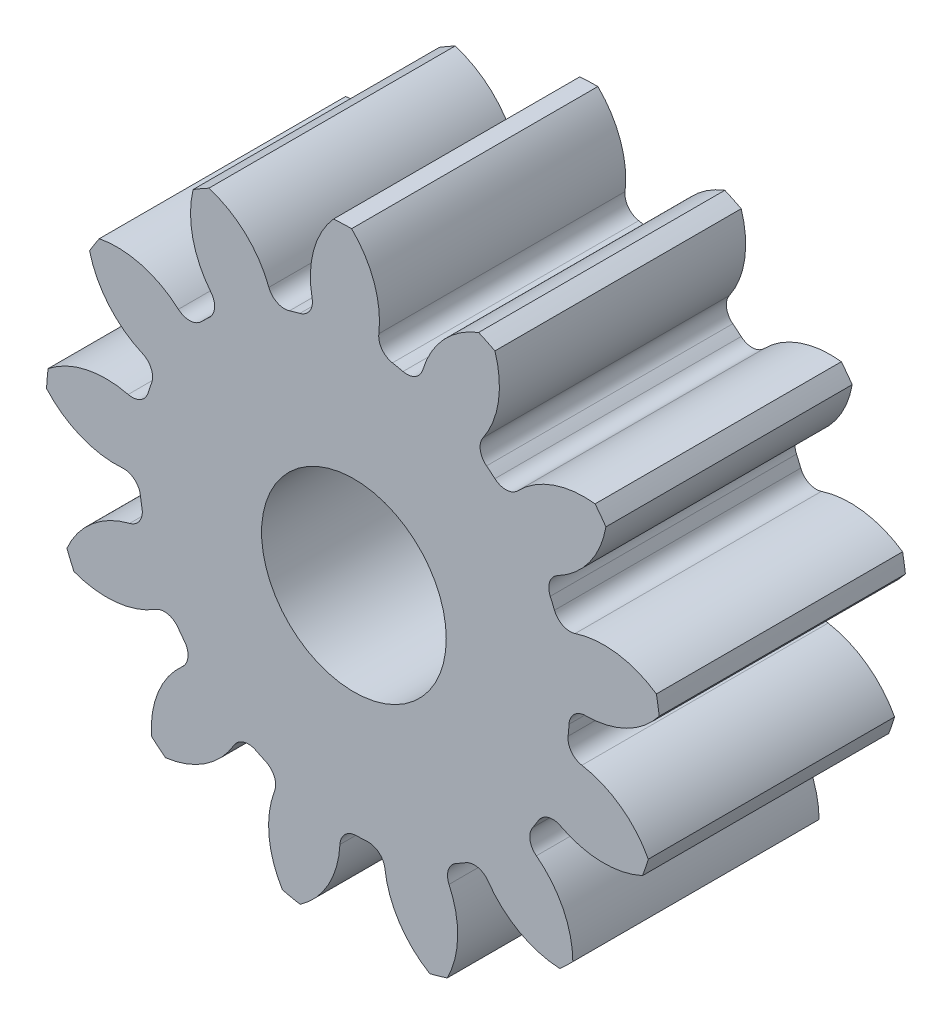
from build123d import *

# Parameters (mm, degrees)
SKETCH3_R         = 127
GEARBODY_DEPTH    = 101.6
TOOTHCUT_DEPTH    = 207.350575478
CIRPATTERN1_COUNT = 13
BOREDIA_R         = 38.1
BORE_DEPTH        = 12700


with BuildPart() as part:
    # Sketch3 → gearBody (new body)
    with BuildSketch(Plane.XY):
        Circle(SKETCH3_R)
    extrude(amount=GEARBODY_DEPTH)

    # Sketch2 → toothCut (cut, through all)
    with BuildSketch(Plane.XY):
        with BuildLine():
            ThreePointArc((88.371227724, -9.68174109), (88.586551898, -7.458741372), (88.745964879, -5.231034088))
            ThreePointArc((88.745964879, -5.231034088), (90.894268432, -0.62561756), (95.615204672, 1.255294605))
            ThreePointArc((95.615204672, 1.255294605), (113.317467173, 5.619529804), (127, 17.66963113))
            ThreePointArc((127, 17.66963113), (127.771208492, -10.757980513), (122.257503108, -38.656419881))
            ThreePointArc((122.257503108, -38.656419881), (110.782486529, -24.488122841), (94.059185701, -17.225350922))
            ThreePointArc((94.059185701, -17.225350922), (89.719218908, -14.581535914), (88.371227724, -9.68174109))
        make_face()
    toothcut = extrude(amount=TOOTHCUT_DEPTH, mode=Mode.SUBTRACT)

    # CirPattern1: toothCut ×13 about axis
    cirpattern1_axis = Axis((0, 0, 0), (0, 0, 1))
    for i in range(1, CIRPATTERN1_COUNT):
        add(toothcut.rotate(cirpattern1_axis, i * 360 / CIRPATTERN1_COUNT), mode=Mode.SUBTRACT)

    # boreDia → bore (cut, symmetric)
    with BuildSketch(Plane.XY):
        Circle(BOREDIA_R)
    extrude(amount=BORE_DEPTH, both=True, mode=Mode.SUBTRACT)


solid = part.part
